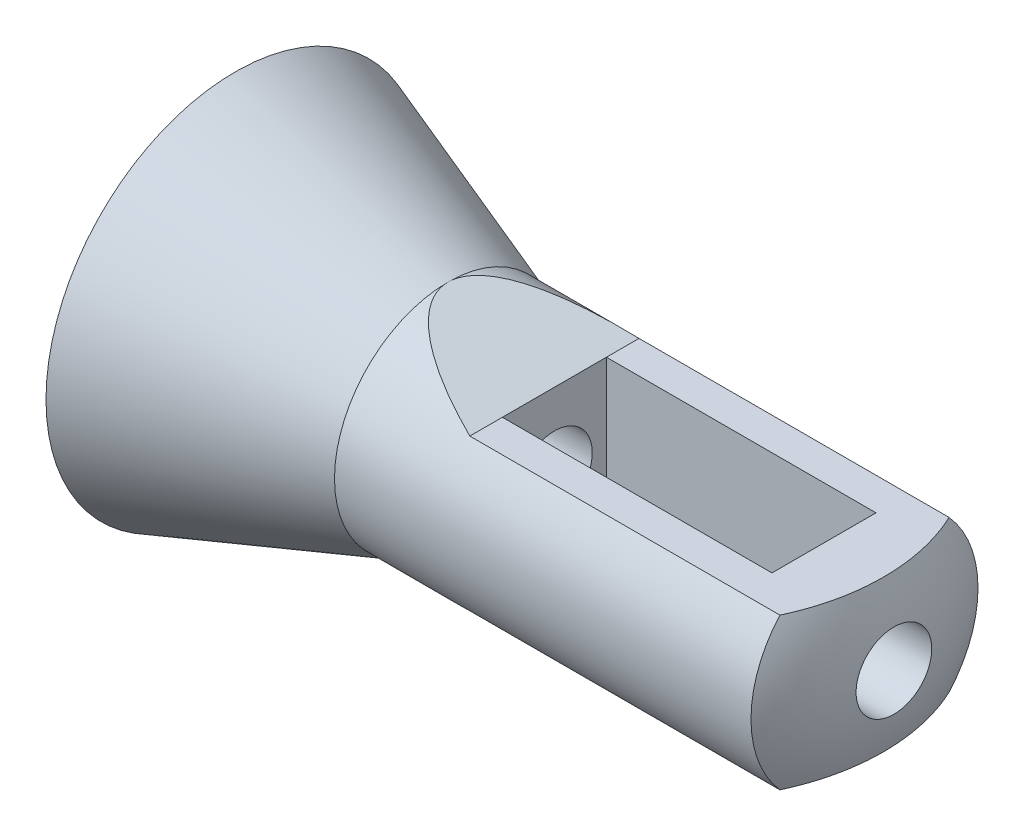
from build123d import *

# Parameters (mm, degrees)
SHELL1_T           = -16
CUT_EXTRUDE1_DEPTH = 151.332312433
SKETCH3_W          = 57
SKETCH3_H          = 22
CUT_EXTRUDE2_DEPTH = 156.357021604


with BuildPart() as part:
    # Sketch1 → Revolve1 (revolve)
    with BuildSketch(Plane(origin=(0, 0, 0), x_dir=(1, 0, 0), z_dir=(0, 1, 0)), mode=Mode.PRIVATE) as revolve1_sk:
        with BuildLine():
            Line((0, 0), (0, 40))
            Line((0, 40), (45, 24))
            Line((45, 24), (133.065732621, 24))
            ThreePointArc((133.065732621, 24), (138.23168958, 12.490837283), (140, 0))
            Line((140, 0), (0, 0))
        make_face()
    revolve(revolve1_sk.sketch.rotate(Axis((0, 0, 0), (1, 0, 0)), 180), axis=Axis((0, 0, 0), (1, 0, 0)))

    # Shell1
    shell1_openings = [part.faces().sort_by_distance(p)[0] for p in [
        (138.23168958, 0, -12.490837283),
        (0, 0, 0),
    ]]
    offset(amount=SHELL1_T, openings=shell1_openings, kind=Kind.INTERSECTION)

    # Sketch2 → Cut-Extrude1 (cut, symmetric)
    with BuildSketch(Plane.XY):
        Polygon((468.305830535, 16), (137.05948169, 16), (67.5, 16), (0, 40), (-312.105175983, 150.970729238), (-199.204268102, 803.772352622), (581.206738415, 668.801623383), align=None)
    cut_extrude1 = extrude(amount=CUT_EXTRUDE1_DEPTH, both=True, mode=Mode.SUBTRACT)

    # Mirror1: Cut-Extrude1 across plane
    add(cut_extrude1.mirror(Plane.ZX), mode=Mode.SUBTRACT)

    # Sketch3 → Cut-Extrude2 (cut, through all)
    with BuildSketch(Plane(origin=(0, 16, 0), x_dir=(1, 0, 0), z_dir=(0, 1, 0))):
        with Locations((96, 0)):
            Rectangle(SKETCH3_W, SKETCH3_H)
    extrude(amount=-CUT_EXTRUDE2_DEPTH, mode=Mode.SUBTRACT)


solid = part.part
